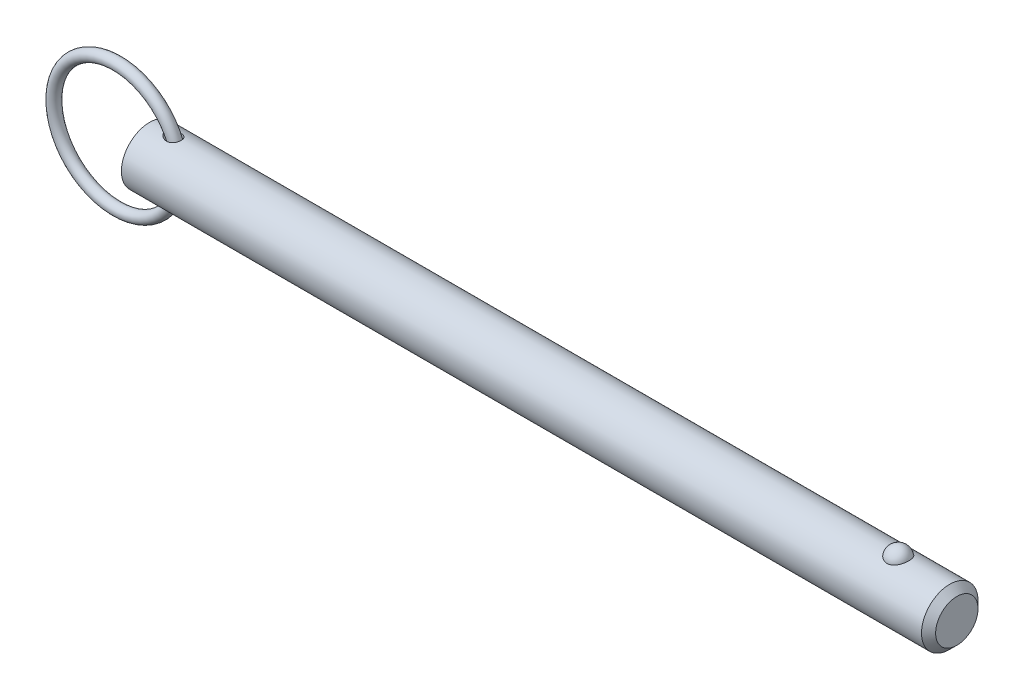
ISO-10303-21;
HEADER;
FILE_DESCRIPTION(('STEP AP214'),'2;1');
FILE_NAME('part.step','',(''),(''),'','','');
FILE_SCHEMA(('AUTOMOTIVE_DESIGN { 1 0 10303 214 1 1 1 1 }'));
ENDSEC;
DATA;
#1=APPLICATION_CONTEXT('core data for automotive mechanical design processes');
#2=APPLICATION_PROTOCOL_DEFINITION('international standard','automotive_design',2000,#1);
#3=PRODUCT_CONTEXT('',#1,'mechanical');
#4=PRODUCT('Part','Part','',(#3));
#5=PRODUCT_RELATED_PRODUCT_CATEGORY('part','',(#4));
#6=PRODUCT_DEFINITION_FORMATION('','',#4);
#7=PRODUCT_DEFINITION_CONTEXT('part definition',#1,'design');
#8=PRODUCT_DEFINITION('design','',#6,#7);
#9=PRODUCT_DEFINITION_SHAPE('','',#8);
#10=(LENGTH_UNIT() NAMED_UNIT(*) SI_UNIT(.MILLI.,.METRE.));
#11=(NAMED_UNIT(*) PLANE_ANGLE_UNIT() SI_UNIT($,.RADIAN.));
#12=(NAMED_UNIT(*) SI_UNIT($,.STERADIAN.) SOLID_ANGLE_UNIT());
#13=UNCERTAINTY_MEASURE_WITH_UNIT(LENGTH_MEASURE(1.E-05),#10,'distance_accuracy_value','');
#14=(GEOMETRIC_REPRESENTATION_CONTEXT(3) GLOBAL_UNCERTAINTY_ASSIGNED_CONTEXT((#13)) GLOBAL_UNIT_ASSIGNED_CONTEXT((#10,
#11,#12)) REPRESENTATION_CONTEXT('',''));
#15=CARTESIAN_POINT('',(0.,0.,0.));
#16=DIRECTION('',(0.,0.,1.));
#17=DIRECTION('',(1.,0.,0.));
#18=AXIS2_PLACEMENT_3D('',#15,#16,#17);
#19=CARTESIAN_POINT('',(-8.23730968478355,0.,0.));
#20=DIRECTION('',(0.,0.,1.));
#21=DIRECTION('',(1.,0.,0.));
#22=AXIS2_PLACEMENT_3D('',#19,#20,#21);
#23=TOROIDAL_SURFACE('',#22,15.875,1.422);
#24=CARTESIAN_POINT('',(9.05969031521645,0.,0.));
#25=VERTEX_POINT('',#24);
#26=VERTEX_LOOP('',#25);
#27=FACE_BOUND('',#26,.T.);
#28=ADVANCED_FACE('P0_F12',(#27),#23,.T.);
#29=CLOSED_SHELL('',(#28));
#30=MANIFOLD_SOLID_BREP('P0_B1',#29);
#31=CARTESIAN_POINT('',(0.,0.,0.));
#32=DIRECTION('',(1.,0.,0.));
#33=DIRECTION('',(0.,0.,-1.));
#34=AXIS2_PLACEMENT_3D('',#31,#32,#33);
#35=CYLINDRICAL_SURFACE('',#34,7.11);
#36=CARTESIAN_POINT('',(3.98467340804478,7.10072679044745,-0.363013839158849));
#37=CARTESIAN_POINT('',(4.00971652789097,7.09600153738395,-0.45539194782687));
#38=CARTESIAN_POINT('',(4.04401947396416,7.08958406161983,-0.545230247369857));
#39=CARTESIAN_POINT('',(4.12810160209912,7.07427055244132,-0.717157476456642));
#40=CARTESIAN_POINT('',(4.17791765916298,7.06536861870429,-0.799227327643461));
#41=CARTESIAN_POINT('',(4.28924471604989,7.04620300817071,-0.953469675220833));
#42=CARTESIAN_POINT('',(4.35063580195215,7.035953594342,-1.02573162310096));
#43=CARTESIAN_POINT('',(4.48282610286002,7.01493313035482,-1.16081412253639));
#44=CARTESIAN_POINT('',(4.55362244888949,7.00416223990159,-1.22363754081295));
#45=CARTESIAN_POINT('',(4.71659336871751,6.98090398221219,-1.35055080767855));
#46=CARTESIAN_POINT('',(4.81029272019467,6.96847103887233,-1.41269256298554));
#47=CARTESIAN_POINT('',(5.0057240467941,6.94515366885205,-1.52319699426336));
#48=CARTESIAN_POINT('',(5.10746392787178,6.93427079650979,-1.57154588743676));
#49=CARTESIAN_POINT('',(5.33503739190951,6.91346066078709,-1.66091325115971));
#50=CARTESIAN_POINT('',(5.46199550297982,6.90402388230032,-1.69921932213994));
#51=CARTESIAN_POINT('',(5.72084799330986,6.89024030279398,-1.75428261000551));
#52=CARTESIAN_POINT('',(5.85274301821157,6.88589416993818,-1.77103699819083));
#53=CARTESIAN_POINT('',(6.11557710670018,6.88337277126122,-1.78081990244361));
#54=CARTESIAN_POINT('',(6.24650031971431,6.88510489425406,-1.77420448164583));
#55=CARTESIAN_POINT('',(6.50446311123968,6.89478744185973,-1.73620392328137));
#56=CARTESIAN_POINT('',(6.6315075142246,6.90272978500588,-1.70485097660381));
#57=CARTESIAN_POINT('',(6.85933269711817,6.92243075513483,-1.62281888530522));
#58=CARTESIAN_POINT('',(6.96133251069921,6.93352131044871,-1.5753580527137));
#59=CARTESIAN_POINT('',(7.15436649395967,6.95824811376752,-1.46226310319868));
#60=CARTESIAN_POINT('',(7.24540699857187,6.97188287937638,-1.3966395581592));
#61=CARTESIAN_POINT('',(7.40446019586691,6.99838217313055,-1.25668991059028));
#62=CARTESIAN_POINT('',(7.473875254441,7.01118308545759,-1.18393777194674));
#63=CARTESIAN_POINT('',(7.59904891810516,7.03582803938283,-1.02736918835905));
#64=CARTESIAN_POINT('',(7.65481029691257,7.04767227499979,-0.943554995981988));
#65=CARTESIAN_POINT('',(7.74982438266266,7.06873077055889,-0.76979592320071));
#66=CARTESIAN_POINT('',(7.7894903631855,7.07800861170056,-0.680084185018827));
#67=CARTESIAN_POINT('',(7.85354088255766,7.09334756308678,-0.495102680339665));
#68=CARTESIAN_POINT('',(7.87792559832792,7.09940871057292,-0.399832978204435));
#69=CARTESIAN_POINT('',(7.9108898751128,7.10766731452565,-0.206294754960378));
#70=CARTESIAN_POINT('',(7.91944662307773,7.10985919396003,-0.108022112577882));
#71=CARTESIAN_POINT('',(7.920501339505,7.11012756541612,0.0886168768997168));
#72=CARTESIAN_POINT('',(7.91299895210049,7.10820396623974,0.186983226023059));
#73=CARTESIAN_POINT('',(7.88205794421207,7.10043733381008,0.381270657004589));
#74=CARTESIAN_POINT('',(7.85857985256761,7.09458459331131,0.477185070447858));
#75=CARTESIAN_POINT('',(7.79617406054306,7.07958431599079,0.663575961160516));
#76=CARTESIAN_POINT('',(7.75724672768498,7.07043685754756,0.754052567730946));
#77=CARTESIAN_POINT('',(7.66496731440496,7.04987259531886,0.926798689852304));
#78=CARTESIAN_POINT('',(7.61164530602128,7.0384605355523,1.00908483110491));
#79=CARTESIAN_POINT('',(7.49191707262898,7.01461776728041,1.16333092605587));
#80=CARTESIAN_POINT('',(7.42551210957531,7.00218715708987,1.235291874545));
#81=CARTESIAN_POINT('',(7.28164031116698,6.97770944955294,1.36680167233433));
#82=CARTESIAN_POINT('',(7.20420170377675,6.96566146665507,1.42638126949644));
#83=CARTESIAN_POINT('',(7.0403906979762,6.94319963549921,1.53199377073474));
#84=CARTESIAN_POINT('',(6.95401827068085,6.93278579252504,1.57802663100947));
#85=CARTESIAN_POINT('',(6.7731858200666,6.91444459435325,1.65656940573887));
#86=CARTESIAN_POINT('',(6.67860569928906,6.90656682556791,1.68881327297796));
#87=CARTESIAN_POINT('',(6.48544119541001,6.89422806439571,1.73849768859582));
#88=CARTESIAN_POINT('',(6.38685561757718,6.88976809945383,1.755933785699));
#89=CARTESIAN_POINT('',(6.18089829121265,6.88429907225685,1.77726234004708));
#90=CARTESIAN_POINT('',(6.07340937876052,6.88356485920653,1.78007646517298));
#91=CARTESIAN_POINT('',(5.85921220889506,6.886086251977,1.77029087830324));
#92=CARTESIAN_POINT('',(5.75250426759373,6.88934339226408,1.75768523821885));
#93=CARTESIAN_POINT('',(5.52848027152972,6.89994454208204,1.71563399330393));
#94=CARTESIAN_POINT('',(5.41155168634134,6.90775772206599,1.68424184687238));
#95=CARTESIAN_POINT('',(5.18376466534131,6.92670168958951,1.60454711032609));
#96=CARTESIAN_POINT('',(5.07291446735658,6.9378368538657,1.5562221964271));
#97=CARTESIAN_POINT('',(4.84835244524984,6.96347168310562,1.43744827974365));
#98=CARTESIAN_POINT('',(4.73562531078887,6.97820486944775,1.36517310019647));
#99=CARTESIAN_POINT('',(4.52504912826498,7.00822340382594,1.20158053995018));
#100=CARTESIAN_POINT('',(4.42717478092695,7.02350775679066,1.11029618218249));
#101=CARTESIAN_POINT('',(4.27935716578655,7.04784659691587,0.940654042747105));
#102=CARTESIAN_POINT('',(4.2239722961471,7.05736064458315,0.867099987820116));
#103=CARTESIAN_POINT('',(4.12558347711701,7.07469854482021,0.711919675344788));
#104=CARTESIAN_POINT('',(4.08256922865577,7.0825238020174,0.630300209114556));
#105=CARTESIAN_POINT('',(4.01142860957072,7.09565978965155,0.459428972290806));
#106=CARTESIAN_POINT('',(3.98346043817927,7.10094374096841,0.370107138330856));
#107=CARTESIAN_POINT('',(3.95517285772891,7.1063173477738,0.233358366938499));
#108=CARTESIAN_POINT('',(3.94802115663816,7.1076831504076,0.187321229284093));
#109=CARTESIAN_POINT('',(3.93842121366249,7.10951900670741,0.0947476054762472));
#110=CARTESIAN_POINT('',(3.93597129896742,7.10998937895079,0.0482113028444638));
#111=CARTESIAN_POINT('',(3.93584361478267,7.11001358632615,-0.0598597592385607));
#112=CARTESIAN_POINT('',(3.9399538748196,7.10922402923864,-0.121405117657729));
#113=CARTESIAN_POINT('',(3.95632793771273,7.10609781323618,-0.243320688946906));
#114=CARTESIAN_POINT('',(3.96859135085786,7.10376122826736,-0.303690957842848));
#115=CARTESIAN_POINT('',(3.98467340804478,7.10072679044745,-0.363013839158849));
#116=B_SPLINE_CURVE_WITH_KNOTS('',3,(#36,#37,#38,#39,#40,#41,#42,#43,#44,#45,#46,#47,#48,#49,
#50,#51,#52,#53,#54,#55,#56,#57,#58,#59,#60,#61,#62,#63,#64,#65,#66,#67,#68,#69,#70,#71,#72,#73,
#74,#75,#76,#77,#78,#79,#80,#81,#82,#83,#84,#85,#86,#87,#88,#89,#90,#91,#92,#93,#94,#95,#96,#97,
#98,#99,#100,#101,#102,#103,#104,#105,#106,#107,#108,#109,#110,#111,#112,#113,#114,#115),
.UNSPECIFIED.,.T.,.F.,(4,2,2,2,2,2,2,2,2,2,2,2,2,2,2,2,2,2,2,2,2,2,2,2,2,2,2,2,2,2,2,2,2,2,2,2,
2,2,2,4),(0.,0.287206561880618,0.575101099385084,0.860162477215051,1.14513709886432,
1.48324846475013,1.82169652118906,2.21865672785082,2.6156690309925,3.00665870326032,
3.39714041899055,3.73437585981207,4.07141541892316,4.37402271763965,4.67656849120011,
4.97076150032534,5.26495110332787,5.55956439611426,5.85418421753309,6.14953461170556,
6.44487798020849,6.73960905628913,7.03431171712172,7.32827352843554,7.6222362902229,
7.9216396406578,8.22113296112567,8.54242840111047,8.86384740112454,9.22635035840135,
9.58933304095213,9.99153142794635,10.3930368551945,10.6697219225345,10.9461759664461,
11.2254825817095,11.3650959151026,11.5046595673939,11.6891051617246,11.8735419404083),.UNSPECIFIED.);
#117=CARTESIAN_POINT('',(3.98467340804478,7.10072679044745,-0.363013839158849));
#118=VERTEX_POINT('',#117);
#119=EDGE_CURVE('P1_E40',#118,#118,#116,.T.);
#120=ORIENTED_EDGE('',*,*,#119,.T.);
#121=EDGE_LOOP('',(#120));
#122=FACE_BOUND('',#121,.T.);
#123=CARTESIAN_POINT('',(201.3925,0.,0.));
#124=DIRECTION('',(1.,0.,0.));
#125=DIRECTION('',(0.,0.,-1.));
#126=AXIS2_PLACEMENT_3D('',#123,#124,#125);
#127=CIRCLE('',#126,7.11);
#128=CARTESIAN_POINT('',(201.3925,0.,-7.11));
#129=VERTEX_POINT('',#128);
#130=EDGE_CURVE('P1_E25',#129,#129,#127,.T.);
#131=ORIENTED_EDGE('',*,*,#130,.F.);
#132=EDGE_LOOP('',(#131));
#133=FACE_BOUND('',#132,.T.);
#134=CARTESIAN_POINT('',(0.,0.,0.));
#135=DIRECTION('',(1.,0.,0.));
#136=DIRECTION('',(0.,0.,-1.));
#137=AXIS2_PLACEMENT_3D('',#134,#135,#136);
#138=CIRCLE('',#137,7.11);
#139=CARTESIAN_POINT('',(0.,0.,-7.11));
#140=VERTEX_POINT('',#139);
#141=EDGE_CURVE('P1_E9',#140,#140,#138,.T.);
#142=ORIENTED_EDGE('',*,*,#141,.T.);
#143=EDGE_LOOP('',(#142));
#144=FACE_BOUND('',#143,.T.);
#145=CARTESIAN_POINT('',(188.429258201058,6.5364666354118,2.79762469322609));
#146=CARTESIAN_POINT('',(188.284429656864,6.53647876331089,2.79761243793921));
#147=CARTESIAN_POINT('',(188.139368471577,6.54144531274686,2.78608115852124));
#148=CARTESIAN_POINT('',(187.853292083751,6.56077791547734,2.7402328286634));
#149=CARTESIAN_POINT('',(187.71228845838,6.5751685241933,2.7058562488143));
#150=CARTESIAN_POINT('',(187.43888335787,6.61165072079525,2.61544042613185));
#151=CARTESIAN_POINT('',(187.306460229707,6.63372195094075,2.55945840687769));
#152=CARTESIAN_POINT('',(187.053233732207,6.6831601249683,2.42742958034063));
#153=CARTESIAN_POINT('',(186.932425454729,6.71052481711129,2.35139129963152));
#154=CARTESIAN_POINT('',(186.701637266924,6.76860821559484,2.17866150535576));
#155=CARTESIAN_POINT('',(186.592085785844,6.79940242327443,2.0814234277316));
#156=CARTESIAN_POINT('',(186.39033404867,6.86050242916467,1.87020907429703));
#157=CARTESIAN_POINT('',(186.298139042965,6.89080807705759,1.75622775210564));
#158=CARTESIAN_POINT('',(186.12925478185,6.94923069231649,1.50900646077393));
#159=CARTESIAN_POINT('',(186.053428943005,6.97719213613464,1.3751387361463));
#160=CARTESIAN_POINT('',(185.924206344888,7.02647251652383,1.09584817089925));
#161=CARTESIAN_POINT('',(185.870810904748,7.04779106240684,0.950424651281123));
#162=CARTESIAN_POINT('',(185.787101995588,7.08180248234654,0.650508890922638));
#163=CARTESIAN_POINT('',(185.757025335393,7.09440672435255,0.495940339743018));
#164=CARTESIAN_POINT('',(185.721473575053,7.10935121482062,0.183515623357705));
#165=CARTESIAN_POINT('',(185.715997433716,7.11169189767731,0.0256595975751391));
#166=CARTESIAN_POINT('',(185.729700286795,7.10589702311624,-0.287512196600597));
#167=CARTESIAN_POINT('',(185.74868231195,7.0978451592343,-0.442838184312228));
#168=CARTESIAN_POINT('',(185.81057450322,7.07221860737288,-0.747830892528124));
#169=CARTESIAN_POINT('',(185.853485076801,7.05464375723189,-0.897497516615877));
#170=CARTESIAN_POINT('',(185.962452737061,7.01171031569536,-1.18722864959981));
#171=CARTESIAN_POINT('',(186.028545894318,6.98633960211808,-1.32727778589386));
#172=CARTESIAN_POINT('',(186.182536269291,6.93042258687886,-1.59370324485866));
#173=CARTESIAN_POINT('',(186.270435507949,6.89987580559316,-1.72007829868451));
#174=CARTESIAN_POINT('',(186.466926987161,6.83659510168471,-1.95657345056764));
#175=CARTESIAN_POINT('',(186.575664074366,6.80384697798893,-2.0665695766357));
#176=CARTESIAN_POINT('',(186.810968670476,6.7400183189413,-2.26611005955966));
#177=CARTESIAN_POINT('',(186.937535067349,6.70893767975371,-2.35565569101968));
#178=CARTESIAN_POINT('',(187.202845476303,6.65264442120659,-2.51019726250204));
#179=CARTESIAN_POINT('',(187.341323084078,6.62733449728,-2.57561395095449));
#180=CARTESIAN_POINT('',(187.628519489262,6.58495995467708,-2.68211134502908));
#181=CARTESIAN_POINT('',(187.777234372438,6.56789220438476,-2.7232012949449));
#182=CARTESIAN_POINT('',(188.072626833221,6.54478663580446,-2.7782581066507));
#183=CARTESIAN_POINT('',(188.21902951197,6.53823639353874,-2.79348727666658));
#184=CARTESIAN_POINT('',(188.512470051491,6.53532718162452,-2.80028921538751));
#185=CARTESIAN_POINT('',(188.659507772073,6.53896606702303,-2.7918669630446));
#186=CARTESIAN_POINT('',(188.944921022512,6.55570357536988,-2.75232178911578));
#187=CARTESIAN_POINT('',(189.083422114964,6.56848455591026,-2.72196077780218));
#188=CARTESIAN_POINT('',(189.353114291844,6.60173528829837,-2.64028774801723));
#189=CARTESIAN_POINT('',(189.484304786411,6.62220565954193,-2.58897404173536));
#190=CARTESIAN_POINT('',(189.738846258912,6.66917927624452,-2.46547820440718));
#191=CARTESIAN_POINT('',(189.861969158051,6.69580233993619,-2.39287266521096));
#192=CARTESIAN_POINT('',(190.094441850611,6.75207041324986,-2.22915269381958));
#193=CARTESIAN_POINT('',(190.203788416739,6.78171612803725,-2.13803393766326));
#194=CARTESIAN_POINT('',(190.411642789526,6.84264629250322,-1.93445592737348));
#195=CARTESIAN_POINT('',(190.509317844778,6.87393748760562,-1.82114774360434));
#196=CARTESIAN_POINT('',(190.685011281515,6.93345710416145,-1.57947787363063));
#197=CARTESIAN_POINT('',(190.763026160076,6.96168497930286,-1.45111351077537));
#198=CARTESIAN_POINT('',(190.899985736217,7.01307558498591,-1.17842708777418));
#199=CARTESIAN_POINT('',(190.958258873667,7.03605262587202,-1.03373189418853));
#200=CARTESIAN_POINT('',(191.051081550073,7.07340932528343,-0.735867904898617));
#201=CARTESIAN_POINT('',(191.085631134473,7.08778900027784,-0.582699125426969));
#202=CARTESIAN_POINT('',(191.130274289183,7.10647639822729,-0.272420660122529));
#203=CARTESIAN_POINT('',(191.14039710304,7.11079616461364,-0.115315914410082));
#204=CARTESIAN_POINT('',(191.136061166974,7.10896059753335,0.198488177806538));
#205=CARTESIAN_POINT('',(191.121603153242,7.10280557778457,0.355187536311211));
#206=CARTESIAN_POINT('',(191.068572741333,7.08071500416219,0.662724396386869));
#207=CARTESIAN_POINT('',(191.03015058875,7.06484039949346,0.813592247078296));
#208=CARTESIAN_POINT('',(190.930101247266,7.0249589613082,1.10629159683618));
#209=CARTESIAN_POINT('',(190.868472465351,7.00095156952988,1.24812247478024));
#210=CARTESIAN_POINT('',(190.722766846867,6.94706632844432,1.51976439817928));
#211=CARTESIAN_POINT('',(190.638544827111,6.91715085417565,1.6494901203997));
#212=CARTESIAN_POINT('',(190.449586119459,6.85470565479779,1.89231285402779));
#213=CARTESIAN_POINT('',(190.344850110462,6.82217601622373,2.0054104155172));
#214=CARTESIAN_POINT('',(190.117103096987,6.75805358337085,2.21190674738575));
#215=CARTESIAN_POINT('',(189.994082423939,6.72646129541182,2.30529503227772));
#216=CARTESIAN_POINT('',(189.73273470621,6.66789520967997,2.46959908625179));
#217=CARTESIAN_POINT('',(189.594401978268,6.64092313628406,2.54050647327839));
#218=CARTESIAN_POINT('',(189.311182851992,6.5957258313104,2.65560045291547));
#219=CARTESIAN_POINT('',(189.166666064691,6.57724013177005,2.70059539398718));
#220=CARTESIAN_POINT('',(188.871546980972,6.55006426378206,2.76587321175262));
#221=CARTESIAN_POINT('',(188.720964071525,6.54134511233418,2.78622922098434));
#222=CARTESIAN_POINT('',(188.523046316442,6.53697847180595,2.79642434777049));
#223=CARTESIAN_POINT('',(188.476164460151,6.53646270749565,2.79762866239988));
#224=CARTESIAN_POINT('',(188.429258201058,6.5364666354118,2.79762469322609));
#225=B_SPLINE_CURVE_WITH_KNOTS('',3,(#145,#146,#147,#148,#149,#150,#151,#152,#153,#154,#155,
#156,#157,#158,#159,#160,#161,#162,#163,#164,#165,#166,#167,#168,#169,#170,#171,#172,#173,#174,
#175,#176,#177,#178,#179,#180,#181,#182,#183,#184,#185,#186,#187,#188,#189,#190,#191,#192,#193,
#194,#195,#196,#197,#198,#199,#200,#201,#202,#203,#204,#205,#206,#207,#208,#209,#210,#211,#212,
#213,#214,#215,#216,#217,#218,#219,#220,#221,#222,#223,#224),.UNSPECIFIED.,.T.,.F.,(4,2,2,2,2,2,
2,2,2,2,2,2,2,2,2,2,2,2,2,2,2,2,2,2,2,2,2,2,2,2,2,2,2,2,2,2,2,2,2,4),(0.,0.434355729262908,
0.86984774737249,1.30419416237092,1.73835621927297,2.18541922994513,2.63261726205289,
3.09954261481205,3.56649542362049,4.03813031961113,4.50974525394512,4.97758575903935,
5.44543423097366,5.91401389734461,6.3826370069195,6.85464418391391,7.32662193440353,
7.78992971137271,8.25306131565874,8.69285754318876,9.13256119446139,9.55768625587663,
9.98284556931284,10.4171106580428,10.8514772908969,11.3079089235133,11.7644218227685,
12.2351898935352,12.7059570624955,13.1761603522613,13.6463495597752,14.1136200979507,
14.580922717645,15.0513032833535,15.5216682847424,15.9922828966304,16.4630727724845,
16.9182457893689,17.372064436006,17.5127411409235),.UNSPECIFIED.);
#226=CARTESIAN_POINT('',(188.429258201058,6.5364666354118,2.79762469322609));
#227=VERTEX_POINT('',#226);
#228=EDGE_CURVE('P1_E34',#227,#227,#225,.T.);
#229=ORIENTED_EDGE('',*,*,#228,.T.);
#230=EDGE_LOOP('',(#229));
#231=FACE_BOUND('',#230,.T.);
#232=CARTESIAN_POINT('',(3.98467340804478,-7.10072679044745,-0.363013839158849));
#233=CARTESIAN_POINT('',(3.96426456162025,-7.10457733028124,-0.287714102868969));
#234=CARTESIAN_POINT('',(3.95000501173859,-7.10730349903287,-0.210695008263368));
#235=CARTESIAN_POINT('',(3.93481801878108,-7.11020840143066,-0.0553038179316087));
#236=CARTESIAN_POINT('',(3.93388435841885,-7.11038832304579,0.0230676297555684));
#237=CARTESIAN_POINT('',(3.94541910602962,-7.10817995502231,0.178714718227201));
#238=CARTESIAN_POINT('',(3.95787987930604,-7.10579312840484,0.25599095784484));
#239=CARTESIAN_POINT('',(3.99523775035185,-7.09872642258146,0.407352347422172));
#240=CARTESIAN_POINT('',(4.02014065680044,-7.09404547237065,0.481435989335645));
#241=CARTESIAN_POINT('',(4.08119600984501,-7.08278363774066,0.625775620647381));
#242=CARTESIAN_POINT('',(4.11749458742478,-7.07617815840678,0.695967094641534));
#243=CARTESIAN_POINT('',(4.19940836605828,-7.06165305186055,0.830508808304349));
#244=CARTESIAN_POINT('',(4.24502952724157,-7.0537325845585,0.894855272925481));
#245=CARTESIAN_POINT('',(4.36790232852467,-7.03310314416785,1.04688574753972));
#246=CARTESIAN_POINT('',(4.44977459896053,-7.01993229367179,1.13078695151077));
#247=CARTESIAN_POINT('',(4.62610796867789,-6.99351259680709,1.28411726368));
#248=CARTESIAN_POINT('',(4.7205898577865,-6.98026365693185,1.35352197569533));
#249=CARTESIAN_POINT('',(4.92036507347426,-6.9549104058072,1.47831921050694));
#250=CARTESIAN_POINT('',(5.02579054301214,-6.94282458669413,1.53350332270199));
#251=CARTESIAN_POINT('',(5.24378330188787,-6.92129098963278,1.62793610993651));
#252=CARTESIAN_POINT('',(5.35635066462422,-6.91184323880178,1.66718462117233));
#253=CARTESIAN_POINT('',(5.60134354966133,-6.89573491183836,1.73269893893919));
#254=CARTESIAN_POINT('',(5.73444697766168,-6.8895970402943,1.75661057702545));
#255=CARTESIAN_POINT('',(6.00300738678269,-6.88344616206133,1.78057487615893));
#256=CARTESIAN_POINT('',(6.13846360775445,-6.88343121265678,1.78063510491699));
#257=CARTESIAN_POINT('',(6.39660470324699,-6.88981379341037,1.75576480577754));
#258=CARTESIAN_POINT('',(6.51947843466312,-6.89572457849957,1.73273121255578));
#259=CARTESIAN_POINT('',(6.75813770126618,-6.91274434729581,1.66352936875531));
#260=CARTESIAN_POINT('',(6.87393155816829,-6.92384709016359,1.61738888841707));
#261=CARTESIAN_POINT('',(7.07801861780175,-6.94787316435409,1.51052664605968));
#262=CARTESIAN_POINT('',(7.16789841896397,-6.96033024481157,1.45271574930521));
#263=CARTESIAN_POINT('',(7.33546773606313,-6.98638661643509,1.32171912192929));
#264=CARTESIAN_POINT('',(7.41316182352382,-6.99998547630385,1.24853918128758));
#265=CARTESIAN_POINT('',(7.54861420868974,-7.02559503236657,1.09486170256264));
#266=CARTESIAN_POINT('',(7.60741145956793,-7.03764930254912,1.01528346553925));
#267=CARTESIAN_POINT('',(7.71070740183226,-7.0598657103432,0.847099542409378));
#268=CARTESIAN_POINT('',(7.75520788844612,-7.0700280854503,0.758494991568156));
#269=CARTESIAN_POINT('',(7.82836147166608,-7.08722075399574,0.575936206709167));
#270=CARTESIAN_POINT('',(7.85719783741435,-7.09428707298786,0.482058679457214));
#271=CARTESIAN_POINT('',(7.89918378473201,-7.10470260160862,0.29065874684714));
#272=CARTESIAN_POINT('',(7.91233308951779,-7.10805174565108,0.193136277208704));
#273=CARTESIAN_POINT('',(7.92267451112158,-7.11067890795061,-0.00313968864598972));
#274=CARTESIAN_POINT('',(7.91981203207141,-7.10994299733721,-0.10189624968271));
#275=CARTESIAN_POINT('',(7.89806489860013,-7.10444651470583,-0.297516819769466));
#276=CARTESIAN_POINT('',(7.87918005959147,-7.09968589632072,-0.394380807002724));
#277=CARTESIAN_POINT('',(7.82577988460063,-7.0866471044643,-0.58355375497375));
#278=CARTESIAN_POINT('',(7.79124976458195,-7.07836560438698,-0.675858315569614));
#279=CARTESIAN_POINT('',(7.70736343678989,-7.05919003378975,-0.853167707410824));
#280=CARTESIAN_POINT('',(7.65800801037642,-7.04829610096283,-0.938172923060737));
#281=CARTESIAN_POINT('',(7.54590141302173,-7.02513961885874,-1.09819812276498));
#282=CARTESIAN_POINT('',(7.48319521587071,-7.01288172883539,-1.17325029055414));
#283=CARTESIAN_POINT('',(7.34599775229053,-6.98832192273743,-1.31164333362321));
#284=CARTESIAN_POINT('',(7.27150757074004,-6.97602001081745,-1.37498528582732));
#285=CARTESIAN_POINT('',(7.11277776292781,-6.95268608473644,-1.48849974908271));
#286=CARTESIAN_POINT('',(7.02852525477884,-6.94165578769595,-1.53865456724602));
#287=CARTESIAN_POINT('',(6.85282430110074,-6.92200320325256,-1.62478650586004));
#288=CARTESIAN_POINT('',(6.76137511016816,-6.91338116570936,-1.66076215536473));
#289=CARTESIAN_POINT('',(6.57061179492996,-6.89906044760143,-1.71930563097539));
#290=CARTESIAN_POINT('',(6.47113516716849,-6.89347290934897,-1.74136795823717));
#291=CARTESIAN_POINT('',(6.26989833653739,-6.88605020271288,-1.7704895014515));
#292=CARTESIAN_POINT('',(6.16813737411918,-6.88421630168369,-1.77754365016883));
#293=CARTESIAN_POINT('',(5.95492537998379,-6.88424071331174,-1.77745174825));
#294=CARTESIAN_POINT('',(5.8434768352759,-6.88646827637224,-1.76888555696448));
#295=CARTESIAN_POINT('',(5.62307560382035,-6.89483827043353,-1.73596677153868));
#296=CARTESIAN_POINT('',(5.51412477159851,-6.90098351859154,-1.71160281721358));
#297=CARTESIAN_POINT('',(5.28644478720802,-6.91743803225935,-1.64393691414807));
#298=CARTESIAN_POINT('',(5.16837217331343,-6.92819628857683,-1.59852806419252));
#299=CARTESIAN_POINT('',(4.94091825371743,-6.95234836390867,-1.4899796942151));
#300=CARTESIAN_POINT('',(4.83153887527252,-6.96574276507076,-1.42683625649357));
#301=CARTESIAN_POINT('',(4.63576710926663,-6.99209234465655,-1.29112257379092));
#302=CARTESIAN_POINT('',(4.54816728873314,-7.00494184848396,-1.22027748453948));
#303=CARTESIAN_POINT('',(4.38554897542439,-7.03019055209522,-1.0652111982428));
#304=CARTESIAN_POINT('',(4.31052141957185,-7.04259007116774,-0.980999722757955));
#305=CARTESIAN_POINT('',(4.18551811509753,-7.0640229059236,-0.811206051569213));
#306=CARTESIAN_POINT('',(4.13358417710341,-7.07328321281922,-0.727107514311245));
#307=CARTESIAN_POINT('',(4.04607461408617,-7.0891994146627,-0.550580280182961));
#308=CARTESIAN_POINT('',(4.01046401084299,-7.09586087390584,-0.458169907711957));
#309=CARTESIAN_POINT('',(3.98467340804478,-7.10072679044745,-0.363013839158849));
#310=B_SPLINE_CURVE_WITH_KNOTS('',3,(#232,#233,#234,#235,#236,#237,#238,#239,#240,#241,#242,
#243,#244,#245,#246,#247,#248,#249,#250,#251,#252,#253,#254,#255,#256,#257,#258,#259,#260,#261,
#262,#263,#264,#265,#266,#267,#268,#269,#270,#271,#272,#273,#274,#275,#276,#277,#278,#279,#280,
#281,#282,#283,#284,#285,#286,#287,#288,#289,#290,#291,#292,#293,#294,#295,#296,#297,#298,#299,
#300,#301,#302,#303,#304,#305,#306,#307,#308,#309),.UNSPECIFIED.,.T.,.F.,(4,2,2,2,2,2,2,2,2,2,2,
2,2,2,2,2,2,2,2,2,2,2,2,2,2,2,2,2,2,2,2,2,2,2,2,2,2,2,4),(0.,0.23402065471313,0.467932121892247,
0.701710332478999,0.935597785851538,1.17261620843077,1.40978663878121,1.76177576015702,
2.11435255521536,2.47183528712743,2.8293216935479,3.23332937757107,3.63720887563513,
4.01042610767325,4.38319587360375,4.70425151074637,5.02518641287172,5.32277979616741,
5.62033579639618,5.91433101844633,6.2083314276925,6.50333490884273,6.79834178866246,
7.09362801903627,7.38889868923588,7.6831900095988,7.9774542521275,8.27211131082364,
8.56679892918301,8.8716552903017,9.17661456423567,9.51069129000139,9.84500851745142,
10.2243046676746,10.6036846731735,10.9425776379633,11.2812252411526,11.5775945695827,
11.8733258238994),.UNSPECIFIED.);
#311=CARTESIAN_POINT('',(3.98467340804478,-7.10072679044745,-0.363013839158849));
#312=VERTEX_POINT('',#311);
#313=EDGE_CURVE('P1_E17',#312,#312,#310,.T.);
#314=ORIENTED_EDGE('',*,*,#313,.T.);
#315=EDGE_LOOP('',(#314));
#316=FACE_BOUND('',#315,.T.);
#317=ADVANCED_FACE('P1_F13',(#122,#133,#144,#231,#316),#35,.T.);
#318=CARTESIAN_POINT('',(0.,0.,0.));
#319=DIRECTION('',(-1.,0.,0.));
#320=DIRECTION('',(0.,0.,1.));
#321=AXIS2_PLACEMENT_3D('',#318,#319,#320);
#322=PLANE('',#321);
#323=ORIENTED_EDGE('',*,*,#141,.F.);
#324=EDGE_LOOP('',(#323));
#325=FACE_BOUND('',#324,.T.);
#326=ADVANCED_FACE('P1_F15',(#325),#322,.T.);
#327=CARTESIAN_POINT('',(203.17,0.,0.));
#328=DIRECTION('',(-1.,0.,0.));
#329=DIRECTION('',(0.,0.,1.));
#330=AXIS2_PLACEMENT_3D('',#327,#328,#329);
#331=CONICAL_SURFACE('',#330,5.33250000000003,0.785398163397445);
#332=ORIENTED_EDGE('',*,*,#130,.T.);
#333=EDGE_LOOP('',(#332));
#334=FACE_BOUND('',#333,.T.);
#335=CARTESIAN_POINT('',(203.17,0.,0.));
#336=DIRECTION('',(1.,0.,0.));
#337=DIRECTION('',(0.,0.,-1.));
#338=AXIS2_PLACEMENT_3D('',#335,#336,#337);
#339=CIRCLE('',#338,5.33250000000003);
#340=CARTESIAN_POINT('',(203.17,0.,-5.33250000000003));
#341=VERTEX_POINT('',#340);
#342=EDGE_CURVE('P1_E30',#341,#341,#339,.T.);
#343=ORIENTED_EDGE('',*,*,#342,.F.);
#344=EDGE_LOOP('',(#343));
#345=FACE_BOUND('',#344,.T.);
#346=ADVANCED_FACE('P1_F55',(#334,#345),#331,.T.);
#347=CARTESIAN_POINT('',(203.17,5.33250000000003,0.));
#348=DIRECTION('',(1.,0.,0.));
#349=DIRECTION('',(0.,0.,-1.));
#350=AXIS2_PLACEMENT_3D('',#347,#348,#349);
#351=PLANE('',#350);
#352=ORIENTED_EDGE('',*,*,#342,.T.);
#353=EDGE_LOOP('',(#352));
#354=FACE_BOUND('',#353,.T.);
#355=ADVANCED_FACE('P1_F51',(#354),#351,.T.);
#356=CARTESIAN_POINT('',(188.429258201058,6.399,0.));
#357=DIRECTION('',(-1.,0.,0.));
#358=DIRECTION('',(0.,1.,0.));
#359=AXIS2_PLACEMENT_3D('',#356,#357,#358);
#360=SPHERICAL_SURFACE('',#359,2.80099999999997);
#361=ORIENTED_EDGE('',*,*,#228,.F.);
#362=EDGE_LOOP('',(#361));
#363=FACE_BOUND('',#362,.T.);
#364=ADVANCED_FACE('P1_F46',(#363),#360,.T.);
#365=CARTESIAN_POINT('',(-8.23730968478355,0.,0.));
#366=DIRECTION('',(0.,0.,1.));
#367=DIRECTION('',(1.,0.,0.));
#368=AXIS2_PLACEMENT_3D('',#365,#366,#367);
#369=TOROIDAL_SURFACE('',#368,15.875,1.7775);
#370=ORIENTED_EDGE('',*,*,#313,.F.);
#371=EDGE_LOOP('',(#370));
#372=FACE_BOUND('',#371,.T.);
#373=ORIENTED_EDGE('',*,*,#119,.F.);
#374=EDGE_LOOP('',(#373));
#375=FACE_BOUND('',#374,.T.);
#376=ADVANCED_FACE('P1_F50',(#372,#375),#369,.F.);
#377=CLOSED_SHELL('',(#317,#326,#346,#355,#364,#376));
#378=MANIFOLD_SOLID_BREP('P1_B1',#377);
#379=ADVANCED_BREP_SHAPE_REPRESENTATION('',(#18,#30,#378),#14);
#380=SHAPE_DEFINITION_REPRESENTATION(#9,#379);
ENDSEC;
END-ISO-10303-21;
